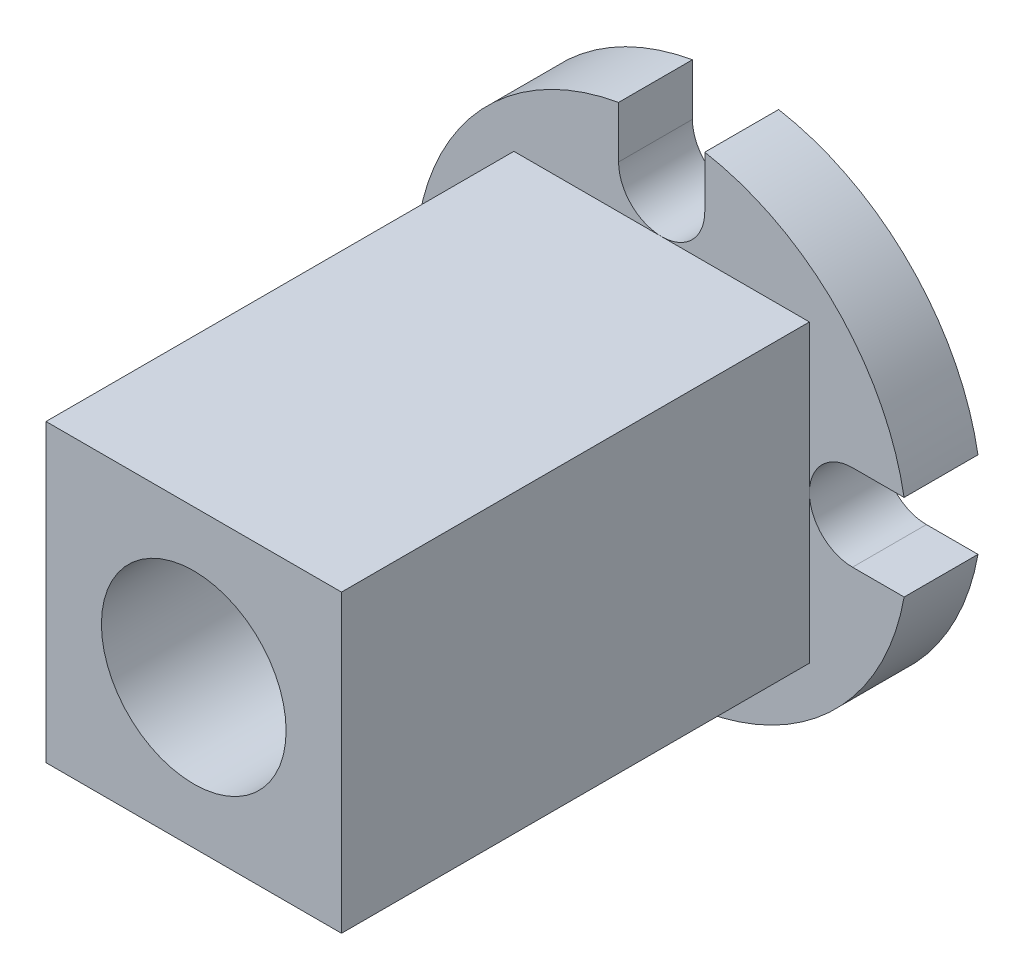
ISO-10303-21;
HEADER;
FILE_DESCRIPTION(('STEP AP214'),'2;1');
FILE_NAME('part.step','',(''),(''),'','','');
FILE_SCHEMA(('AUTOMOTIVE_DESIGN { 1 0 10303 214 1 1 1 1 }'));
ENDSEC;
DATA;
#1=APPLICATION_CONTEXT('core data for automotive mechanical design processes');
#2=APPLICATION_PROTOCOL_DEFINITION('international standard','automotive_design',2000,#1);
#3=PRODUCT_CONTEXT('',#1,'mechanical');
#4=PRODUCT('Part','Part','',(#3));
#5=PRODUCT_RELATED_PRODUCT_CATEGORY('part','',(#4));
#6=PRODUCT_DEFINITION_FORMATION('','',#4);
#7=PRODUCT_DEFINITION_CONTEXT('part definition',#1,'design');
#8=PRODUCT_DEFINITION('design','',#6,#7);
#9=PRODUCT_DEFINITION_SHAPE('','',#8);
#10=(LENGTH_UNIT() NAMED_UNIT(*) SI_UNIT(.MILLI.,.METRE.));
#11=(NAMED_UNIT(*) PLANE_ANGLE_UNIT() SI_UNIT($,.RADIAN.));
#12=(NAMED_UNIT(*) SI_UNIT($,.STERADIAN.) SOLID_ANGLE_UNIT());
#13=UNCERTAINTY_MEASURE_WITH_UNIT(LENGTH_MEASURE(1.E-05),#10,'distance_accuracy_value','');
#14=(GEOMETRIC_REPRESENTATION_CONTEXT(3) GLOBAL_UNCERTAINTY_ASSIGNED_CONTEXT((#13)) GLOBAL_UNIT_ASSIGNED_CONTEXT((#10,
#11,#12)) REPRESENTATION_CONTEXT('',''));
#15=CARTESIAN_POINT('',(0.,0.,0.));
#16=DIRECTION('',(0.,0.,1.));
#17=DIRECTION('',(1.,0.,0.));
#18=AXIS2_PLACEMENT_3D('',#15,#16,#17);
#19=CARTESIAN_POINT('',(-12.,12.,44.));
#20=DIRECTION('',(0.,0.,1.));
#21=DIRECTION('',(0.,-1.,0.));
#22=AXIS2_PLACEMENT_3D('',#19,#20,#21);
#23=PLANE('',#22);
#24=DIRECTION('',(-1.,0.,0.));
#25=VECTOR('',#24,1.);
#26=CARTESIAN_POINT('',(12.,12.,44.));
#27=LINE('',#26,#25);
#28=CARTESIAN_POINT('',(12.,12.,44.));
#29=VERTEX_POINT('',#28);
#30=CARTESIAN_POINT('',(-12.,12.,44.));
#31=VERTEX_POINT('',#30);
#32=EDGE_CURVE('E177',#29,#31,#27,.T.);
#33=ORIENTED_EDGE('',*,*,#32,.T.);
#34=DIRECTION('',(0.,-1.,0.));
#35=VECTOR('',#34,1.);
#36=CARTESIAN_POINT('',(-12.,12.,44.));
#37=LINE('',#36,#35);
#38=CARTESIAN_POINT('',(-12.,-12.,44.));
#39=VERTEX_POINT('',#38);
#40=EDGE_CURVE('E165',#31,#39,#37,.T.);
#41=ORIENTED_EDGE('',*,*,#40,.T.);
#42=DIRECTION('',(1.,0.,0.));
#43=VECTOR('',#42,1.);
#44=CARTESIAN_POINT('',(12.,-12.,44.));
#45=LINE('',#44,#43);
#46=CARTESIAN_POINT('',(12.,-12.,44.));
#47=VERTEX_POINT('',#46);
#48=EDGE_CURVE('E176',#39,#47,#45,.T.);
#49=ORIENTED_EDGE('',*,*,#48,.T.);
#50=DIRECTION('',(0.,1.,0.));
#51=VECTOR('',#50,1.);
#52=CARTESIAN_POINT('',(12.,12.,44.));
#53=LINE('',#52,#51);
#54=EDGE_CURVE('E182',#47,#29,#53,.T.);
#55=ORIENTED_EDGE('',*,*,#54,.T.);
#56=EDGE_LOOP('',(#33,#41,#49,#55));
#57=FACE_BOUND('',#56,.T.);
#58=CARTESIAN_POINT('',(0.,0.,44.));
#59=DIRECTION('',(0.,0.,1.));
#60=DIRECTION('',(1.,0.,0.));
#61=AXIS2_PLACEMENT_3D('',#58,#59,#60);
#62=CIRCLE('',#61,7.5);
#63=CARTESIAN_POINT('',(7.5,0.,44.));
#64=VERTEX_POINT('',#63);
#65=EDGE_CURVE('E500',#64,#64,#62,.T.);
#66=ORIENTED_EDGE('',*,*,#65,.F.);
#67=EDGE_LOOP('',(#66));
#68=FACE_BOUND('',#67,.T.);
#69=ADVANCED_FACE('F14',(#57,#68),#23,.T.);
#70=CARTESIAN_POINT('',(0.,-1.43938680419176E-12,6.));
#71=DIRECTION('',(0.,0.,1.));
#72=DIRECTION('',(0.,-1.,0.));
#73=AXIS2_PLACEMENT_3D('',#70,#71,#72);
#74=PLANE('',#73);
#75=DIRECTION('',(0.,1.,0.));
#76=VECTOR('',#75,1.);
#77=CARTESIAN_POINT('',(12.,12.,6.));
#78=LINE('',#77,#76);
#79=CARTESIAN_POINT('',(12.,-12.,6.));
#80=VERTEX_POINT('',#79);
#81=CARTESIAN_POINT('',(12.,-1.43071318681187E-12,6.));
#82=VERTEX_POINT('',#81);
#83=EDGE_CURVE('E29',#80,#82,#78,.T.);
#84=ORIENTED_EDGE('',*,*,#83,.F.);
#85=DIRECTION('',(1.,0.,0.));
#86=VECTOR('',#85,1.);
#87=CARTESIAN_POINT('',(12.,-12.,6.));
#88=LINE('',#87,#86);
#89=CARTESIAN_POINT('',(-5.06177854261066E-13,-12.,6.));
#90=VERTEX_POINT('',#89);
#91=EDGE_CURVE('E495',#90,#80,#88,.T.);
#92=ORIENTED_EDGE('',*,*,#91,.F.);
#93=CARTESIAN_POINT('',(-5.05671893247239E-13,-15.5000000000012,6.));
#94=DIRECTION('',(0.,0.,-1.));
#95=DIRECTION('',(0.,-1.,0.));
#96=AXIS2_PLACEMENT_3D('',#93,#94,#95);
#97=CIRCLE('',#96,3.49999999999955);
#98=CARTESIAN_POINT('',(3.49999999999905,-15.5000000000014,6.));
#99=VERTEX_POINT('',#98);
#100=EDGE_CURVE('E233',#90,#99,#97,.T.);
#101=ORIENTED_EDGE('',*,*,#100,.T.);
#102=DIRECTION('',(0.,-1.,0.));
#103=VECTOR('',#102,1.);
#104=CARTESIAN_POINT('',(3.49999999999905,-15.5000000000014,6.));
#105=LINE('',#104,#103);
#106=CARTESIAN_POINT('',(3.49999999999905,-19.6913686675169,6.));
#107=VERTEX_POINT('',#106);
#108=EDGE_CURVE('E237',#99,#107,#105,.T.);
#109=ORIENTED_EDGE('',*,*,#108,.T.);
#110=CARTESIAN_POINT('',(0.,-1.43938680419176E-12,6.));
#111=DIRECTION('',(0.,0.,1.));
#112=DIRECTION('',(0.,-1.,0.));
#113=AXIS2_PLACEMENT_3D('',#110,#111,#112);
#114=CIRCLE('',#113,20.);
#115=CARTESIAN_POINT('',(19.6913686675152,-3.50000000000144,6.));
#116=VERTEX_POINT('',#115);
#117=EDGE_CURVE('E199',#107,#116,#114,.T.);
#118=ORIENTED_EDGE('',*,*,#117,.T.);
#119=DIRECTION('',(-1.,0.,0.));
#120=VECTOR('',#119,1.);
#121=CARTESIAN_POINT('',(19.6913686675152,-3.50000000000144,6.));
#122=LINE('',#121,#120);
#123=CARTESIAN_POINT('',(15.5,-3.50000000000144,6.));
#124=VERTEX_POINT('',#123);
#125=EDGE_CURVE('E202',#116,#124,#122,.T.);
#126=ORIENTED_EDGE('',*,*,#125,.T.);
#127=CARTESIAN_POINT('',(15.5,-1.43071318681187E-12,6.));
#128=DIRECTION('',(0.,0.,-1.));
#129=DIRECTION('',(0.,-1.,0.));
#130=AXIS2_PLACEMENT_3D('',#127,#128,#129);
#131=CIRCLE('',#130,3.5);
#132=EDGE_CURVE('E206',#124,#82,#131,.T.);
#133=ORIENTED_EDGE('',*,*,#132,.T.);
#134=EDGE_LOOP('',(#84,#92,#101,#109,#118,#126,#133));
#135=FACE_BOUND('',#134,.T.);
#136=ADVANCED_FACE('F337',(#135),#74,.T.);
#137=CARTESIAN_POINT('',(12.,12.,6.));
#138=VERTEX_POINT('',#137);
#139=EDGE_CURVE('E318',#82,#138,#78,.T.);
#140=ORIENTED_EDGE('',*,*,#139,.F.);
#141=CARTESIAN_POINT('',(15.5,3.49999999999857,6.));
#142=VERTEX_POINT('',#141);
#143=EDGE_CURVE('E205',#82,#142,#131,.T.);
#144=ORIENTED_EDGE('',*,*,#143,.T.);
#145=DIRECTION('',(1.,0.,0.));
#146=VECTOR('',#145,1.);
#147=CARTESIAN_POINT('',(19.6913686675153,3.49999999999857,6.));
#148=LINE('',#147,#146);
#149=CARTESIAN_POINT('',(19.6913686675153,3.49999999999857,6.));
#150=VERTEX_POINT('',#149);
#151=EDGE_CURVE('E208',#142,#150,#148,.T.);
#152=ORIENTED_EDGE('',*,*,#151,.T.);
#153=CARTESIAN_POINT('',(0.,-1.43938680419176E-12,6.));
#154=DIRECTION('',(0.,0.,1.));
#155=DIRECTION('',(0.,-1.,0.));
#156=AXIS2_PLACEMENT_3D('',#153,#154,#155);
#157=CIRCLE('',#156,20.);
#158=CARTESIAN_POINT('',(3.50000000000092,19.6913686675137,6.));
#159=VERTEX_POINT('',#158);
#160=EDGE_CURVE('E210',#150,#159,#157,.T.);
#161=ORIENTED_EDGE('',*,*,#160,.T.);
#162=DIRECTION('',(0.,-1.,0.));
#163=VECTOR('',#162,1.);
#164=CARTESIAN_POINT('',(3.50000000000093,19.6913686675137,6.));
#165=LINE('',#164,#163);
#166=CARTESIAN_POINT('',(3.50000000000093,15.4999999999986,6.));
#167=VERTEX_POINT('',#166);
#168=EDGE_CURVE('E212',#159,#167,#165,.T.);
#169=ORIENTED_EDGE('',*,*,#168,.T.);
#170=CARTESIAN_POINT('',(9.20270804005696E-13,15.4999999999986,6.));
#171=DIRECTION('',(0.,0.,-1.));
#172=DIRECTION('',(0.,-1.,0.));
#173=AXIS2_PLACEMENT_3D('',#170,#171,#172);
#174=CIRCLE('',#173,3.5);
#175=CARTESIAN_POINT('',(9.21029745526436E-13,12.,6.));
#176=VERTEX_POINT('',#175);
#177=EDGE_CURVE('E215',#167,#176,#174,.T.);
#178=ORIENTED_EDGE('',*,*,#177,.T.);
#179=DIRECTION('',(-1.,0.,0.));
#180=VECTOR('',#179,1.);
#181=CARTESIAN_POINT('',(12.,12.,6.));
#182=LINE('',#181,#180);
#183=EDGE_CURVE('E37',#138,#176,#182,.T.);
#184=ORIENTED_EDGE('',*,*,#183,.F.);
#185=EDGE_LOOP('',(#140,#144,#152,#161,#169,#178,#184));
#186=FACE_BOUND('',#185,.T.);
#187=ADVANCED_FACE('F343',(#186),#74,.T.);
#188=CARTESIAN_POINT('',(-12.,12.,6.));
#189=VERTEX_POINT('',#188);
#190=EDGE_CURVE('E189',#176,#189,#182,.T.);
#191=ORIENTED_EDGE('',*,*,#190,.F.);
#192=CARTESIAN_POINT('',(-3.49999999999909,15.4999999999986,6.));
#193=VERTEX_POINT('',#192);
#194=EDGE_CURVE('E214',#176,#193,#174,.T.);
#195=ORIENTED_EDGE('',*,*,#194,.T.);
#196=DIRECTION('',(0.,1.,0.));
#197=VECTOR('',#196,1.);
#198=CARTESIAN_POINT('',(-3.49999999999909,19.691368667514,6.));
#199=LINE('',#198,#197);
#200=CARTESIAN_POINT('',(-3.49999999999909,19.691368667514,6.));
#201=VERTEX_POINT('',#200);
#202=EDGE_CURVE('E217',#193,#201,#199,.T.);
#203=ORIENTED_EDGE('',*,*,#202,.T.);
#204=CARTESIAN_POINT('',(0.,-1.43938680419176E-12,6.));
#205=DIRECTION('',(0.,0.,1.));
#206=DIRECTION('',(0.,-1.,0.));
#207=AXIS2_PLACEMENT_3D('',#204,#205,#206);
#208=CIRCLE('',#207,20.);
#209=CARTESIAN_POINT('',(-19.691368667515,3.5,6.));
#210=VERTEX_POINT('',#209);
#211=EDGE_CURVE('E219',#201,#210,#208,.T.);
#212=ORIENTED_EDGE('',*,*,#211,.T.);
#213=DIRECTION('',(1.,0.,0.));
#214=VECTOR('',#213,1.);
#215=CARTESIAN_POINT('',(-15.5,3.5,6.));
#216=LINE('',#215,#214);
#217=CARTESIAN_POINT('',(-15.5,3.5,6.));
#218=VERTEX_POINT('',#217);
#219=EDGE_CURVE('E221',#210,#218,#216,.T.);
#220=ORIENTED_EDGE('',*,*,#219,.T.);
#221=CARTESIAN_POINT('',(-15.5,0.,6.));
#222=DIRECTION('',(0.,0.,-1.));
#223=DIRECTION('',(0.,-1.,0.));
#224=AXIS2_PLACEMENT_3D('',#221,#222,#223);
#225=CIRCLE('',#224,3.5);
#226=CARTESIAN_POINT('',(-12.,0.,6.));
#227=VERTEX_POINT('',#226);
#228=EDGE_CURVE('E224',#218,#227,#225,.T.);
#229=ORIENTED_EDGE('',*,*,#228,.T.);
#230=DIRECTION('',(0.,-1.,0.));
#231=VECTOR('',#230,1.);
#232=CARTESIAN_POINT('',(-12.,12.,6.));
#233=LINE('',#232,#231);
#234=EDGE_CURVE('E493',#189,#227,#233,.T.);
#235=ORIENTED_EDGE('',*,*,#234,.F.);
#236=EDGE_LOOP('',(#191,#195,#203,#212,#220,#229,#235));
#237=FACE_BOUND('',#236,.T.);
#238=ADVANCED_FACE('F367',(#237),#74,.T.);
#239=CARTESIAN_POINT('',(0.,-1.43938680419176E-12,6.));
#240=DIRECTION('',(0.,0.,-1.));
#241=DIRECTION('',(0.,1.,0.));
#242=AXIS2_PLACEMENT_3D('',#239,#240,#241);
#243=CYLINDRICAL_SURFACE('',#242,20.);
#244=CARTESIAN_POINT('',(0.,-1.43938680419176E-12,0.));
#245=DIRECTION('',(0.,0.,1.));
#246=DIRECTION('',(0.,-1.,0.));
#247=AXIS2_PLACEMENT_3D('',#244,#245,#246);
#248=CIRCLE('',#247,20.);
#249=CARTESIAN_POINT('',(3.49999999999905,-19.6913686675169,0.));
#250=VERTEX_POINT('',#249);
#251=CARTESIAN_POINT('',(19.6913686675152,-3.50000000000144,0.));
#252=VERTEX_POINT('',#251);
#253=EDGE_CURVE('E190',#250,#252,#248,.T.);
#254=ORIENTED_EDGE('',*,*,#253,.T.);
#255=DIRECTION('',(0.,0.,-1.));
#256=VECTOR('',#255,1.);
#257=CARTESIAN_POINT('',(19.6913686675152,-3.50000000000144,6.));
#258=LINE('',#257,#256);
#259=EDGE_CURVE('E312',#116,#252,#258,.T.);
#260=ORIENTED_EDGE('',*,*,#259,.F.);
#261=ORIENTED_EDGE('',*,*,#117,.F.);
#262=DIRECTION('',(0.,0.,-1.));
#263=VECTOR('',#262,1.);
#264=CARTESIAN_POINT('',(3.49999999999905,-19.6913686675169,6.));
#265=LINE('',#264,#263);
#266=EDGE_CURVE('E238',#107,#250,#265,.T.);
#267=ORIENTED_EDGE('',*,*,#266,.T.);
#268=EDGE_LOOP('',(#254,#260,#261,#267));
#269=FACE_BOUND('',#268,.T.);
#270=ADVANCED_FACE('F428',(#269),#243,.T.);
#271=CARTESIAN_POINT('',(19.6913686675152,-3.50000000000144,6.));
#272=DIRECTION('',(0.,-1.,0.));
#273=DIRECTION('',(0.,0.,-1.));
#274=AXIS2_PLACEMENT_3D('',#271,#272,#273);
#275=PLANE('',#274);
#276=DIRECTION('',(-1.,0.,0.));
#277=VECTOR('',#276,1.);
#278=CARTESIAN_POINT('',(19.6913686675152,-3.50000000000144,0.));
#279=LINE('',#278,#277);
#280=CARTESIAN_POINT('',(15.5,-3.50000000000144,0.));
#281=VERTEX_POINT('',#280);
#282=EDGE_CURVE('E193',#252,#281,#279,.T.);
#283=ORIENTED_EDGE('',*,*,#282,.T.);
#284=DIRECTION('',(0.,0.,-1.));
#285=VECTOR('',#284,1.);
#286=CARTESIAN_POINT('',(15.5,-3.50000000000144,6.));
#287=LINE('',#286,#285);
#288=EDGE_CURVE('E309',#124,#281,#287,.T.);
#289=ORIENTED_EDGE('',*,*,#288,.F.);
#290=ORIENTED_EDGE('',*,*,#125,.F.);
#291=ORIENTED_EDGE('',*,*,#259,.T.);
#292=EDGE_LOOP('',(#283,#289,#290,#291));
#293=FACE_BOUND('',#292,.T.);
#294=ADVANCED_FACE('F425',(#293),#275,.F.);
#295=CARTESIAN_POINT('',(15.5,-1.43071318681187E-12,6.));
#296=DIRECTION('',(0.,0.,-1.));
#297=DIRECTION('',(0.,1.,0.));
#298=AXIS2_PLACEMENT_3D('',#295,#296,#297);
#299=CYLINDRICAL_SURFACE('',#298,3.5);
#300=CARTESIAN_POINT('',(15.5,-1.43071318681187E-12,0.));
#301=DIRECTION('',(0.,0.,-1.));
#302=DIRECTION('',(0.,-1.,0.));
#303=AXIS2_PLACEMENT_3D('',#300,#301,#302);
#304=CIRCLE('',#303,3.5);
#305=CARTESIAN_POINT('',(15.5,3.49999999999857,0.));
#306=VERTEX_POINT('',#305);
#307=EDGE_CURVE('E241',#281,#306,#304,.T.);
#308=ORIENTED_EDGE('',*,*,#307,.T.);
#309=DIRECTION('',(0.,0.,-1.));
#310=VECTOR('',#309,1.);
#311=CARTESIAN_POINT('',(15.5,3.49999999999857,6.));
#312=LINE('',#311,#310);
#313=EDGE_CURVE('E306',#142,#306,#312,.T.);
#314=ORIENTED_EDGE('',*,*,#313,.F.);
#315=ORIENTED_EDGE('',*,*,#143,.F.);
#316=ORIENTED_EDGE('',*,*,#132,.F.);
#317=ORIENTED_EDGE('',*,*,#288,.T.);
#318=EDGE_LOOP('',(#308,#314,#315,#316,#317));
#319=FACE_BOUND('',#318,.T.);
#320=ADVANCED_FACE('F421',(#319),#299,.F.);
#321=CARTESIAN_POINT('',(19.6913686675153,3.49999999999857,6.));
#322=DIRECTION('',(0.,1.,0.));
#323=DIRECTION('',(0.,0.,1.));
#324=AXIS2_PLACEMENT_3D('',#321,#322,#323);
#325=PLANE('',#324);
#326=DIRECTION('',(1.,0.,0.));
#327=VECTOR('',#326,1.);
#328=CARTESIAN_POINT('',(19.6913686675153,3.49999999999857,0.));
#329=LINE('',#328,#327);
#330=CARTESIAN_POINT('',(19.6913686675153,3.49999999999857,0.));
#331=VERTEX_POINT('',#330);
#332=EDGE_CURVE('E243',#306,#331,#329,.T.);
#333=ORIENTED_EDGE('',*,*,#332,.T.);
#334=DIRECTION('',(0.,0.,-1.));
#335=VECTOR('',#334,1.);
#336=CARTESIAN_POINT('',(19.6913686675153,3.49999999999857,6.));
#337=LINE('',#336,#335);
#338=EDGE_CURVE('E303',#150,#331,#337,.T.);
#339=ORIENTED_EDGE('',*,*,#338,.F.);
#340=ORIENTED_EDGE('',*,*,#151,.F.);
#341=ORIENTED_EDGE('',*,*,#313,.T.);
#342=EDGE_LOOP('',(#333,#339,#340,#341));
#343=FACE_BOUND('',#342,.T.);
#344=ADVANCED_FACE('F417',(#343),#325,.F.);
#345=CARTESIAN_POINT('',(0.,-1.43938680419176E-12,6.));
#346=DIRECTION('',(0.,0.,-1.));
#347=DIRECTION('',(0.,1.,0.));
#348=AXIS2_PLACEMENT_3D('',#345,#346,#347);
#349=CYLINDRICAL_SURFACE('',#348,20.);
#350=CARTESIAN_POINT('',(0.,-1.43938680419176E-12,0.));
#351=DIRECTION('',(0.,0.,1.));
#352=DIRECTION('',(0.,-1.,0.));
#353=AXIS2_PLACEMENT_3D('',#350,#351,#352);
#354=CIRCLE('',#353,20.);
#355=CARTESIAN_POINT('',(3.50000000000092,19.6913686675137,0.));
#356=VERTEX_POINT('',#355);
#357=EDGE_CURVE('E245',#331,#356,#354,.T.);
#358=ORIENTED_EDGE('',*,*,#357,.T.);
#359=DIRECTION('',(0.,0.,-1.));
#360=VECTOR('',#359,1.);
#361=CARTESIAN_POINT('',(3.50000000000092,19.6913686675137,6.));
#362=LINE('',#361,#360);
#363=EDGE_CURVE('E300',#159,#356,#362,.T.);
#364=ORIENTED_EDGE('',*,*,#363,.F.);
#365=ORIENTED_EDGE('',*,*,#160,.F.);
#366=ORIENTED_EDGE('',*,*,#338,.T.);
#367=EDGE_LOOP('',(#358,#364,#365,#366));
#368=FACE_BOUND('',#367,.T.);
#369=ADVANCED_FACE('F413',(#368),#349,.T.);
#370=CARTESIAN_POINT('',(3.50000000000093,19.6913686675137,6.));
#371=DIRECTION('',(1.,0.,0.));
#372=DIRECTION('',(0.,0.,1.));
#373=AXIS2_PLACEMENT_3D('',#370,#371,#372);
#374=PLANE('',#373);
#375=DIRECTION('',(0.,-1.,0.));
#376=VECTOR('',#375,1.);
#377=CARTESIAN_POINT('',(3.50000000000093,19.6913686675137,0.));
#378=LINE('',#377,#376);
#379=CARTESIAN_POINT('',(3.50000000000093,15.4999999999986,0.));
#380=VERTEX_POINT('',#379);
#381=EDGE_CURVE('E247',#356,#380,#378,.T.);
#382=ORIENTED_EDGE('',*,*,#381,.T.);
#383=DIRECTION('',(0.,0.,-1.));
#384=VECTOR('',#383,1.);
#385=CARTESIAN_POINT('',(3.50000000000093,15.4999999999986,6.));
#386=LINE('',#385,#384);
#387=EDGE_CURVE('E297',#167,#380,#386,.T.);
#388=ORIENTED_EDGE('',*,*,#387,.F.);
#389=ORIENTED_EDGE('',*,*,#168,.F.);
#390=ORIENTED_EDGE('',*,*,#363,.T.);
#391=EDGE_LOOP('',(#382,#388,#389,#390));
#392=FACE_BOUND('',#391,.T.);
#393=ADVANCED_FACE('F409',(#392),#374,.F.);
#394=CARTESIAN_POINT('',(9.20270804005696E-13,15.4999999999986,6.));
#395=DIRECTION('',(0.,0.,-1.));
#396=DIRECTION('',(0.,1.,0.));
#397=AXIS2_PLACEMENT_3D('',#394,#395,#396);
#398=CYLINDRICAL_SURFACE('',#397,3.5);
#399=CARTESIAN_POINT('',(9.20270804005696E-13,15.4999999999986,0.));
#400=DIRECTION('',(0.,0.,-1.));
#401=DIRECTION('',(0.,-1.,0.));
#402=AXIS2_PLACEMENT_3D('',#399,#400,#401);
#403=CIRCLE('',#402,3.5);
#404=CARTESIAN_POINT('',(-3.49999999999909,15.4999999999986,0.));
#405=VERTEX_POINT('',#404);
#406=EDGE_CURVE('E249',#380,#405,#403,.T.);
#407=ORIENTED_EDGE('',*,*,#406,.T.);
#408=DIRECTION('',(0.,0.,-1.));
#409=VECTOR('',#408,1.);
#410=CARTESIAN_POINT('',(-3.49999999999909,15.4999999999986,6.));
#411=LINE('',#410,#409);
#412=EDGE_CURVE('E294',#193,#405,#411,.T.);
#413=ORIENTED_EDGE('',*,*,#412,.F.);
#414=ORIENTED_EDGE('',*,*,#194,.F.);
#415=ORIENTED_EDGE('',*,*,#177,.F.);
#416=ORIENTED_EDGE('',*,*,#387,.T.);
#417=EDGE_LOOP('',(#407,#413,#414,#415,#416));
#418=FACE_BOUND('',#417,.T.);
#419=ADVANCED_FACE('F405',(#418),#398,.F.);
#420=CARTESIAN_POINT('',(-3.49999999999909,19.691368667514,6.));
#421=DIRECTION('',(-1.,0.,0.));
#422=DIRECTION('',(0.,0.,-1.));
#423=AXIS2_PLACEMENT_3D('',#420,#421,#422);
#424=PLANE('',#423);
#425=DIRECTION('',(0.,1.,0.));
#426=VECTOR('',#425,1.);
#427=CARTESIAN_POINT('',(-3.49999999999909,19.691368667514,0.));
#428=LINE('',#427,#426);
#429=CARTESIAN_POINT('',(-3.49999999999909,19.691368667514,0.));
#430=VERTEX_POINT('',#429);
#431=EDGE_CURVE('E251',#405,#430,#428,.T.);
#432=ORIENTED_EDGE('',*,*,#431,.T.);
#433=DIRECTION('',(0.,0.,-1.));
#434=VECTOR('',#433,1.);
#435=CARTESIAN_POINT('',(-3.49999999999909,19.691368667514,6.));
#436=LINE('',#435,#434);
#437=EDGE_CURVE('E291',#201,#430,#436,.T.);
#438=ORIENTED_EDGE('',*,*,#437,.F.);
#439=ORIENTED_EDGE('',*,*,#202,.F.);
#440=ORIENTED_EDGE('',*,*,#412,.T.);
#441=EDGE_LOOP('',(#432,#438,#439,#440));
#442=FACE_BOUND('',#441,.T.);
#443=ADVANCED_FACE('F401',(#442),#424,.F.);
#444=CARTESIAN_POINT('',(0.,-1.43938680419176E-12,6.));
#445=DIRECTION('',(0.,0.,-1.));
#446=DIRECTION('',(0.,1.,0.));
#447=AXIS2_PLACEMENT_3D('',#444,#445,#446);
#448=CYLINDRICAL_SURFACE('',#447,20.);
#449=CARTESIAN_POINT('',(0.,-1.43938680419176E-12,0.));
#450=DIRECTION('',(0.,0.,1.));
#451=DIRECTION('',(0.,-1.,0.));
#452=AXIS2_PLACEMENT_3D('',#449,#450,#451);
#453=CIRCLE('',#452,20.);
#454=CARTESIAN_POINT('',(-19.691368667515,3.5,0.));
#455=VERTEX_POINT('',#454);
#456=EDGE_CURVE('E253',#430,#455,#453,.T.);
#457=ORIENTED_EDGE('',*,*,#456,.T.);
#458=DIRECTION('',(0.,0.,-1.));
#459=VECTOR('',#458,1.);
#460=CARTESIAN_POINT('',(-19.691368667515,3.5,6.));
#461=LINE('',#460,#459);
#462=EDGE_CURVE('E288',#210,#455,#461,.T.);
#463=ORIENTED_EDGE('',*,*,#462,.F.);
#464=ORIENTED_EDGE('',*,*,#211,.F.);
#465=ORIENTED_EDGE('',*,*,#437,.T.);
#466=EDGE_LOOP('',(#457,#463,#464,#465));
#467=FACE_BOUND('',#466,.T.);
#468=ADVANCED_FACE('F397',(#467),#448,.T.);
#469=CARTESIAN_POINT('',(-15.5,3.5,6.));
#470=DIRECTION('',(0.,1.,0.));
#471=DIRECTION('',(0.,0.,1.));
#472=AXIS2_PLACEMENT_3D('',#469,#470,#471);
#473=PLANE('',#472);
#474=DIRECTION('',(1.,0.,0.));
#475=VECTOR('',#474,1.);
#476=CARTESIAN_POINT('',(-15.5,3.5,0.));
#477=LINE('',#476,#475);
#478=CARTESIAN_POINT('',(-15.5,3.5,0.));
#479=VERTEX_POINT('',#478);
#480=EDGE_CURVE('E255',#455,#479,#477,.T.);
#481=ORIENTED_EDGE('',*,*,#480,.T.);
#482=DIRECTION('',(0.,0.,-1.));
#483=VECTOR('',#482,1.);
#484=CARTESIAN_POINT('',(-15.5,3.5,6.));
#485=LINE('',#484,#483);
#486=EDGE_CURVE('E285',#218,#479,#485,.T.);
#487=ORIENTED_EDGE('',*,*,#486,.F.);
#488=ORIENTED_EDGE('',*,*,#219,.F.);
#489=ORIENTED_EDGE('',*,*,#462,.T.);
#490=EDGE_LOOP('',(#481,#487,#488,#489));
#491=FACE_BOUND('',#490,.T.);
#492=ADVANCED_FACE('F393',(#491),#473,.F.);
#493=CARTESIAN_POINT('',(-15.5,0.,6.));
#494=DIRECTION('',(0.,0.,-1.));
#495=DIRECTION('',(0.,1.,0.));
#496=AXIS2_PLACEMENT_3D('',#493,#494,#495);
#497=CYLINDRICAL_SURFACE('',#496,3.5);
#498=CARTESIAN_POINT('',(-15.5,0.,0.));
#499=DIRECTION('',(0.,0.,-1.));
#500=DIRECTION('',(0.,-1.,0.));
#501=AXIS2_PLACEMENT_3D('',#498,#499,#500);
#502=CIRCLE('',#501,3.5);
#503=CARTESIAN_POINT('',(-15.5,-3.5,0.));
#504=VERTEX_POINT('',#503);
#505=EDGE_CURVE('E257',#479,#504,#502,.T.);
#506=ORIENTED_EDGE('',*,*,#505,.T.);
#507=DIRECTION('',(0.,0.,-1.));
#508=VECTOR('',#507,1.);
#509=CARTESIAN_POINT('',(-15.5,-3.5,6.));
#510=LINE('',#509,#508);
#511=CARTESIAN_POINT('',(-15.5,-3.5,6.));
#512=VERTEX_POINT('',#511);
#513=EDGE_CURVE('E282',#512,#504,#510,.T.);
#514=ORIENTED_EDGE('',*,*,#513,.F.);
#515=EDGE_CURVE('E223',#227,#512,#225,.T.);
#516=ORIENTED_EDGE('',*,*,#515,.F.);
#517=ORIENTED_EDGE('',*,*,#228,.F.);
#518=ORIENTED_EDGE('',*,*,#486,.T.);
#519=EDGE_LOOP('',(#506,#514,#516,#517,#518));
#520=FACE_BOUND('',#519,.T.);
#521=ADVANCED_FACE('F389',(#520),#497,.F.);
#522=CARTESIAN_POINT('',(-15.5,-3.5,6.));
#523=DIRECTION('',(0.,-1.,0.));
#524=DIRECTION('',(0.,0.,-1.));
#525=AXIS2_PLACEMENT_3D('',#522,#523,#524);
#526=PLANE('',#525);
#527=DIRECTION('',(-1.,0.,0.));
#528=VECTOR('',#527,1.);
#529=CARTESIAN_POINT('',(-15.5,-3.5,0.));
#530=LINE('',#529,#528);
#531=CARTESIAN_POINT('',(-19.691368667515,-3.5,0.));
#532=VERTEX_POINT('',#531);
#533=EDGE_CURVE('E259',#504,#532,#530,.T.);
#534=ORIENTED_EDGE('',*,*,#533,.T.);
#535=DIRECTION('',(0.,0.,-1.));
#536=VECTOR('',#535,1.);
#537=CARTESIAN_POINT('',(-19.691368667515,-3.5,6.));
#538=LINE('',#537,#536);
#539=CARTESIAN_POINT('',(-19.691368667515,-3.5,6.));
#540=VERTEX_POINT('',#539);
#541=EDGE_CURVE('E279',#540,#532,#538,.T.);
#542=ORIENTED_EDGE('',*,*,#541,.F.);
#543=DIRECTION('',(-1.,0.,0.));
#544=VECTOR('',#543,1.);
#545=CARTESIAN_POINT('',(-15.5,-3.5,6.));
#546=LINE('',#545,#544);
#547=EDGE_CURVE('E227',#512,#540,#546,.T.);
#548=ORIENTED_EDGE('',*,*,#547,.F.);
#549=ORIENTED_EDGE('',*,*,#513,.T.);
#550=EDGE_LOOP('',(#534,#542,#548,#549));
#551=FACE_BOUND('',#550,.T.);
#552=ADVANCED_FACE('F385',(#551),#526,.F.);
#553=CARTESIAN_POINT('',(0.,-1.43938680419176E-12,6.));
#554=DIRECTION('',(0.,0.,-1.));
#555=DIRECTION('',(0.,1.,0.));
#556=AXIS2_PLACEMENT_3D('',#553,#554,#555);
#557=CYLINDRICAL_SURFACE('',#556,19.9999999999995);
#558=CARTESIAN_POINT('',(0.,-1.43938680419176E-12,0.));
#559=DIRECTION('',(0.,0.,1.));
#560=DIRECTION('',(0.,-1.,0.));
#561=AXIS2_PLACEMENT_3D('',#558,#559,#560);
#562=CIRCLE('',#561,19.9999999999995);
#563=CARTESIAN_POINT('',(-3.50000000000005,-19.6913686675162,0.));
#564=VERTEX_POINT('',#563);
#565=EDGE_CURVE('E261',#532,#564,#562,.T.);
#566=ORIENTED_EDGE('',*,*,#565,.T.);
#567=DIRECTION('',(0.,0.,-1.));
#568=VECTOR('',#567,1.);
#569=CARTESIAN_POINT('',(-3.50000000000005,-19.6913686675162,6.));
#570=LINE('',#569,#568);
#571=CARTESIAN_POINT('',(-3.50000000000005,-19.6913686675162,6.));
#572=VERTEX_POINT('',#571);
#573=EDGE_CURVE('E276',#572,#564,#570,.T.);
#574=ORIENTED_EDGE('',*,*,#573,.F.);
#575=CARTESIAN_POINT('',(0.,-1.43938680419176E-12,6.));
#576=DIRECTION('',(0.,0.,1.));
#577=DIRECTION('',(0.,-1.,0.));
#578=AXIS2_PLACEMENT_3D('',#575,#576,#577);
#579=CIRCLE('',#578,19.9999999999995);
#580=EDGE_CURVE('E229',#540,#572,#579,.T.);
#581=ORIENTED_EDGE('',*,*,#580,.F.);
#582=ORIENTED_EDGE('',*,*,#541,.T.);
#583=EDGE_LOOP('',(#566,#574,#581,#582));
#584=FACE_BOUND('',#583,.T.);
#585=ADVANCED_FACE('F381',(#584),#557,.T.);
#586=CARTESIAN_POINT('',(-3.50000000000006,-15.500000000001,6.));
#587=DIRECTION('',(-1.,0.,0.));
#588=DIRECTION('',(0.,0.,-1.));
#589=AXIS2_PLACEMENT_3D('',#586,#587,#588);
#590=PLANE('',#589);
#591=DIRECTION('',(0.,1.,0.));
#592=VECTOR('',#591,1.);
#593=CARTESIAN_POINT('',(-3.50000000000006,-15.500000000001,0.));
#594=LINE('',#593,#592);
#595=CARTESIAN_POINT('',(-3.50000000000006,-15.500000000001,0.));
#596=VERTEX_POINT('',#595);
#597=EDGE_CURVE('E263',#564,#596,#594,.T.);
#598=ORIENTED_EDGE('',*,*,#597,.T.);
#599=DIRECTION('',(0.,0.,-1.));
#600=VECTOR('',#599,1.);
#601=CARTESIAN_POINT('',(-3.50000000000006,-15.500000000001,6.));
#602=LINE('',#601,#600);
#603=CARTESIAN_POINT('',(-3.50000000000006,-15.500000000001,6.));
#604=VERTEX_POINT('',#603);
#605=EDGE_CURVE('E273',#604,#596,#602,.T.);
#606=ORIENTED_EDGE('',*,*,#605,.F.);
#607=DIRECTION('',(0.,1.,0.));
#608=VECTOR('',#607,1.);
#609=CARTESIAN_POINT('',(-3.50000000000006,-15.500000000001,6.));
#610=LINE('',#609,#608);
#611=EDGE_CURVE('E231',#572,#604,#610,.T.);
#612=ORIENTED_EDGE('',*,*,#611,.F.);
#613=ORIENTED_EDGE('',*,*,#573,.T.);
#614=EDGE_LOOP('',(#598,#606,#612,#613));
#615=FACE_BOUND('',#614,.T.);
#616=ADVANCED_FACE('F377',(#615),#590,.F.);
#617=CARTESIAN_POINT('',(-5.05671893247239E-13,-15.5000000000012,6.));
#618=DIRECTION('',(0.,0.,-1.));
#619=DIRECTION('',(0.,1.,0.));
#620=AXIS2_PLACEMENT_3D('',#617,#618,#619);
#621=CYLINDRICAL_SURFACE('',#620,3.49999999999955);
#622=CARTESIAN_POINT('',(-5.05671893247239E-13,-15.5000000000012,0.));
#623=DIRECTION('',(0.,0.,-1.));
#624=DIRECTION('',(0.,-1.,0.));
#625=AXIS2_PLACEMENT_3D('',#622,#623,#624);
#626=CIRCLE('',#625,3.49999999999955);
#627=CARTESIAN_POINT('',(3.49999999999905,-15.5000000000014,0.));
#628=VERTEX_POINT('',#627);
#629=EDGE_CURVE('E265',#596,#628,#626,.T.);
#630=ORIENTED_EDGE('',*,*,#629,.T.);
#631=DIRECTION('',(0.,0.,-1.));
#632=VECTOR('',#631,1.);
#633=CARTESIAN_POINT('',(3.49999999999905,-15.5000000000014,6.));
#634=LINE('',#633,#632);
#635=EDGE_CURVE('E270',#99,#628,#634,.T.);
#636=ORIENTED_EDGE('',*,*,#635,.F.);
#637=ORIENTED_EDGE('',*,*,#100,.F.);
#638=EDGE_CURVE('E234',#604,#90,#97,.T.);
#639=ORIENTED_EDGE('',*,*,#638,.F.);
#640=ORIENTED_EDGE('',*,*,#605,.T.);
#641=EDGE_LOOP('',(#630,#636,#637,#639,#640));
#642=FACE_BOUND('',#641,.T.);
#643=ADVANCED_FACE('F373',(#642),#621,.F.);
#644=CARTESIAN_POINT('',(3.49999999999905,-15.5000000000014,6.));
#645=DIRECTION('',(1.,0.,0.));
#646=DIRECTION('',(0.,0.,1.));
#647=AXIS2_PLACEMENT_3D('',#644,#645,#646);
#648=PLANE('',#647);
#649=DIRECTION('',(0.,-1.,0.));
#650=VECTOR('',#649,1.);
#651=CARTESIAN_POINT('',(3.49999999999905,-15.5000000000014,0.));
#652=LINE('',#651,#650);
#653=EDGE_CURVE('E203',#628,#250,#652,.T.);
#654=ORIENTED_EDGE('',*,*,#653,.T.);
#655=ORIENTED_EDGE('',*,*,#266,.F.);
#656=ORIENTED_EDGE('',*,*,#108,.F.);
#657=ORIENTED_EDGE('',*,*,#635,.T.);
#658=EDGE_LOOP('',(#654,#655,#656,#657));
#659=FACE_BOUND('',#658,.T.);
#660=ADVANCED_FACE('F365',(#659),#648,.F.);
#661=CARTESIAN_POINT('',(-12.,-12.,6.));
#662=VERTEX_POINT('',#661);
#663=EDGE_CURVE('E490',#662,#90,#88,.T.);
#664=ORIENTED_EDGE('',*,*,#663,.F.);
#665=EDGE_CURVE('E315',#227,#662,#233,.T.);
#666=ORIENTED_EDGE('',*,*,#665,.F.);
#667=ORIENTED_EDGE('',*,*,#515,.T.);
#668=ORIENTED_EDGE('',*,*,#547,.T.);
#669=ORIENTED_EDGE('',*,*,#580,.T.);
#670=ORIENTED_EDGE('',*,*,#611,.T.);
#671=ORIENTED_EDGE('',*,*,#638,.T.);
#672=EDGE_LOOP('',(#664,#666,#667,#668,#669,#670,#671));
#673=FACE_BOUND('',#672,.T.);
#674=ADVANCED_FACE('F345',(#673),#74,.T.);
#675=CARTESIAN_POINT('',(0.,-1.43938680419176E-12,0.));
#676=DIRECTION('',(0.,0.,1.));
#677=DIRECTION('',(0.,-1.,0.));
#678=AXIS2_PLACEMENT_3D('',#675,#676,#677);
#679=PLANE('',#678);
#680=CARTESIAN_POINT('',(0.,0.,0.));
#681=DIRECTION('',(0.,0.,1.));
#682=DIRECTION('',(1.,0.,0.));
#683=AXIS2_PLACEMENT_3D('',#680,#681,#682);
#684=CIRCLE('',#683,3.45);
#685=CARTESIAN_POINT('',(3.45,0.,0.));
#686=VERTEX_POINT('',#685);
#687=EDGE_CURVE('E9',#686,#686,#684,.T.);
#688=ORIENTED_EDGE('',*,*,#687,.T.);
#689=EDGE_LOOP('',(#688));
#690=FACE_BOUND('',#689,.T.);
#691=ORIENTED_EDGE('',*,*,#253,.F.);
#692=ORIENTED_EDGE('',*,*,#653,.F.);
#693=ORIENTED_EDGE('',*,*,#629,.F.);
#694=ORIENTED_EDGE('',*,*,#597,.F.);
#695=ORIENTED_EDGE('',*,*,#565,.F.);
#696=ORIENTED_EDGE('',*,*,#533,.F.);
#697=ORIENTED_EDGE('',*,*,#505,.F.);
#698=ORIENTED_EDGE('',*,*,#480,.F.);
#699=ORIENTED_EDGE('',*,*,#456,.F.);
#700=ORIENTED_EDGE('',*,*,#431,.F.);
#701=ORIENTED_EDGE('',*,*,#406,.F.);
#702=ORIENTED_EDGE('',*,*,#381,.F.);
#703=ORIENTED_EDGE('',*,*,#357,.F.);
#704=ORIENTED_EDGE('',*,*,#332,.F.);
#705=ORIENTED_EDGE('',*,*,#307,.F.);
#706=ORIENTED_EDGE('',*,*,#282,.F.);
#707=EDGE_LOOP('',(#691,#692,#693,#694,#695,#696,#697,#698,#699,#700,#701,#702,#703,#704,#705,#706));
#708=FACE_BOUND('',#707,.T.);
#709=ADVANCED_FACE('F362',(#690,#708),#679,.F.);
#710=CARTESIAN_POINT('',(12.,12.,44.));
#711=DIRECTION('',(0.,-1.,0.));
#712=DIRECTION('',(1.,0.,0.));
#713=AXIS2_PLACEMENT_3D('',#710,#711,#712);
#714=PLANE('',#713);
#715=ORIENTED_EDGE('',*,*,#183,.T.);
#716=ORIENTED_EDGE('',*,*,#190,.T.);
#717=DIRECTION('',(0.,0.,-1.));
#718=VECTOR('',#717,1.);
#719=CARTESIAN_POINT('',(-12.,12.,44.));
#720=LINE('',#719,#718);
#721=EDGE_CURVE('E170',#31,#189,#720,.T.);
#722=ORIENTED_EDGE('',*,*,#721,.F.);
#723=ORIENTED_EDGE('',*,*,#32,.F.);
#724=DIRECTION('',(0.,0.,-1.));
#725=VECTOR('',#724,1.);
#726=CARTESIAN_POINT('',(12.,12.,44.));
#727=LINE('',#726,#725);
#728=EDGE_CURVE('E502',#29,#138,#727,.T.);
#729=ORIENTED_EDGE('',*,*,#728,.T.);
#730=EDGE_LOOP('',(#715,#716,#722,#723,#729));
#731=FACE_BOUND('',#730,.T.);
#732=ADVANCED_FACE('F188',(#731),#714,.F.);
#733=CARTESIAN_POINT('',(-12.,12.,44.));
#734=DIRECTION('',(1.,0.,0.));
#735=DIRECTION('',(0.,0.,1.));
#736=AXIS2_PLACEMENT_3D('',#733,#734,#735);
#737=PLANE('',#736);
#738=ORIENTED_EDGE('',*,*,#234,.T.);
#739=ORIENTED_EDGE('',*,*,#665,.T.);
#740=DIRECTION('',(0.,0.,-1.));
#741=VECTOR('',#740,1.);
#742=CARTESIAN_POINT('',(-12.,-12.,44.));
#743=LINE('',#742,#741);
#744=EDGE_CURVE('E173',#39,#662,#743,.T.);
#745=ORIENTED_EDGE('',*,*,#744,.F.);
#746=ORIENTED_EDGE('',*,*,#40,.F.);
#747=ORIENTED_EDGE('',*,*,#721,.T.);
#748=EDGE_LOOP('',(#738,#739,#745,#746,#747));
#749=FACE_BOUND('',#748,.T.);
#750=ADVANCED_FACE('F168',(#749),#737,.F.);
#751=CARTESIAN_POINT('',(12.,-12.,44.));
#752=DIRECTION('',(0.,1.,0.));
#753=DIRECTION('',(-1.,0.,0.));
#754=AXIS2_PLACEMENT_3D('',#751,#752,#753);
#755=PLANE('',#754);
#756=ORIENTED_EDGE('',*,*,#663,.T.);
#757=ORIENTED_EDGE('',*,*,#91,.T.);
#758=DIRECTION('',(0.,0.,-1.));
#759=VECTOR('',#758,1.);
#760=CARTESIAN_POINT('',(12.,-12.,44.));
#761=LINE('',#760,#759);
#762=EDGE_CURVE('E195',#47,#80,#761,.T.);
#763=ORIENTED_EDGE('',*,*,#762,.F.);
#764=ORIENTED_EDGE('',*,*,#48,.F.);
#765=ORIENTED_EDGE('',*,*,#744,.T.);
#766=EDGE_LOOP('',(#756,#757,#763,#764,#765));
#767=FACE_BOUND('',#766,.T.);
#768=ADVANCED_FACE('F354',(#767),#755,.F.);
#769=CARTESIAN_POINT('',(12.,12.,44.));
#770=DIRECTION('',(-1.,0.,0.));
#771=DIRECTION('',(0.,0.,-1.));
#772=AXIS2_PLACEMENT_3D('',#769,#770,#771);
#773=PLANE('',#772);
#774=ORIENTED_EDGE('',*,*,#83,.T.);
#775=ORIENTED_EDGE('',*,*,#139,.T.);
#776=ORIENTED_EDGE('',*,*,#728,.F.);
#777=ORIENTED_EDGE('',*,*,#54,.F.);
#778=ORIENTED_EDGE('',*,*,#762,.T.);
#779=EDGE_LOOP('',(#774,#775,#776,#777,#778));
#780=FACE_BOUND('',#779,.T.);
#781=ADVANCED_FACE('F350',(#780),#773,.F.);
#782=CARTESIAN_POINT('',(0.,0.,44.));
#783=DIRECTION('',(0.,0.,-1.));
#784=DIRECTION('',(-1.,0.,0.));
#785=AXIS2_PLACEMENT_3D('',#782,#783,#784);
#786=CYLINDRICAL_SURFACE('',#785,7.5);
#787=ORIENTED_EDGE('',*,*,#65,.T.);
#788=EDGE_LOOP('',(#787));
#789=FACE_BOUND('',#788,.T.);
#790=CARTESIAN_POINT('',(0.,0.,24.));
#791=DIRECTION('',(0.,0.,1.));
#792=DIRECTION('',(1.,0.,0.));
#793=AXIS2_PLACEMENT_3D('',#790,#791,#792);
#794=CIRCLE('',#793,7.5);
#795=CARTESIAN_POINT('',(7.5,0.,24.));
#796=VERTEX_POINT('',#795);
#797=EDGE_CURVE('E316',#796,#796,#794,.F.);
#798=ORIENTED_EDGE('',*,*,#797,.T.);
#799=EDGE_LOOP('',(#798));
#800=FACE_BOUND('',#799,.T.);
#801=ADVANCED_FACE('F353',(#789,#800),#786,.F.);
#802=CARTESIAN_POINT('',(0.,0.,24.));
#803=DIRECTION('',(0.,0.,1.));
#804=DIRECTION('',(1.,0.,0.));
#805=AXIS2_PLACEMENT_3D('',#802,#803,#804);
#806=PLANE('',#805);
#807=ORIENTED_EDGE('',*,*,#797,.F.);
#808=EDGE_LOOP('',(#807));
#809=FACE_BOUND('',#808,.T.);
#810=ADVANCED_FACE('F348',(#809),#806,.T.);
#811=CARTESIAN_POINT('',(0.,0.,20.));
#812=DIRECTION('',(0.,0.,-1.));
#813=DIRECTION('',(-1.,0.,0.));
#814=AXIS2_PLACEMENT_3D('',#811,#812,#813);
#815=CYLINDRICAL_SURFACE('',#814,3.);
#816=CARTESIAN_POINT('',(0.,0.,0.45));
#817=DIRECTION('',(0.,0.,1.));
#818=DIRECTION('',(1.,0.,0.));
#819=AXIS2_PLACEMENT_3D('',#816,#817,#818);
#820=CIRCLE('',#819,3.);
#821=CARTESIAN_POINT('',(3.,0.,0.45));
#822=VERTEX_POINT('',#821);
#823=EDGE_CURVE('E22',#822,#822,#820,.F.);
#824=ORIENTED_EDGE('',*,*,#823,.T.);
#825=EDGE_LOOP('',(#824));
#826=FACE_BOUND('',#825,.T.);
#827=CARTESIAN_POINT('',(0.,0.,20.));
#828=DIRECTION('',(0.,0.,-1.));
#829=DIRECTION('',(-1.,0.,0.));
#830=AXIS2_PLACEMENT_3D('',#827,#828,#829);
#831=CIRCLE('',#830,3.);
#832=CARTESIAN_POINT('',(-3.,0.,20.));
#833=VERTEX_POINT('',#832);
#834=EDGE_CURVE('E506',#833,#833,#831,.T.);
#835=ORIENTED_EDGE('',*,*,#834,.F.);
#836=EDGE_LOOP('',(#835));
#837=FACE_BOUND('',#836,.T.);
#838=ADVANCED_FACE('F322',(#826,#837),#815,.F.);
#839=CARTESIAN_POINT('',(0.,0.,20.));
#840=DIRECTION('',(0.,0.,-1.));
#841=DIRECTION('',(-1.,0.,0.));
#842=AXIS2_PLACEMENT_3D('',#839,#840,#841);
#843=PLANE('',#842);
#844=ORIENTED_EDGE('',*,*,#834,.T.);
#845=EDGE_LOOP('',(#844));
#846=FACE_BOUND('',#845,.T.);
#847=ADVANCED_FACE('F326',(#846),#843,.T.);
#848=CARTESIAN_POINT('',(0.,0.,0.45));
#849=DIRECTION('',(0.,0.,-1.));
#850=DIRECTION('',(-1.,0.,0.));
#851=AXIS2_PLACEMENT_3D('',#848,#849,#850);
#852=CONICAL_SURFACE('',#851,3.,0.785398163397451);
#853=ORIENTED_EDGE('',*,*,#687,.F.);
#854=EDGE_LOOP('',(#853));
#855=FACE_BOUND('',#854,.T.);
#856=ORIENTED_EDGE('',*,*,#823,.F.);
#857=EDGE_LOOP('',(#856));
#858=FACE_BOUND('',#857,.T.);
#859=ADVANCED_FACE('F16',(#855,#858),#852,.F.);
#860=CLOSED_SHELL('',(#69,#136,#187,#238,#270,#294,#320,#344,#369,#393,#419,#443,#468,#492,#521,
#552,#585,#616,#643,#660,#674,#709,#732,#750,#768,#781,#801,#810,#838,#847,#859));
#861=MANIFOLD_SOLID_BREP('B1',#860);
#862=ADVANCED_BREP_SHAPE_REPRESENTATION('',(#18,#861),#14);
#863=SHAPE_DEFINITION_REPRESENTATION(#9,#862);
ENDSEC;
END-ISO-10303-21;
